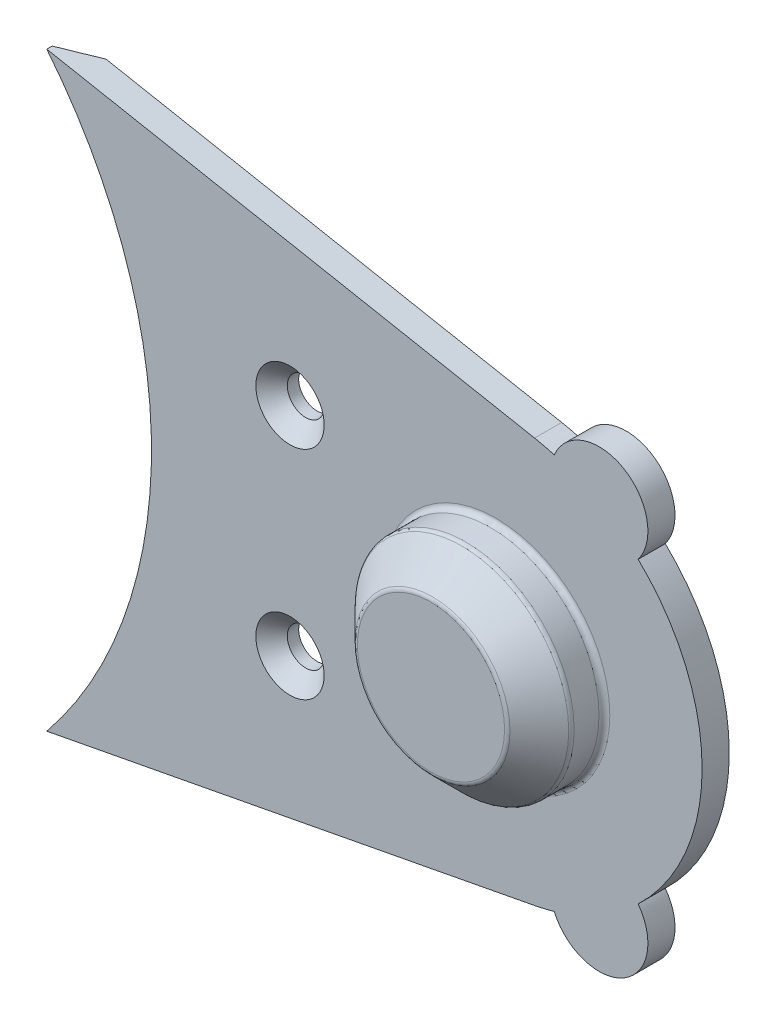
from build123d import *

# Parameters (mm, degrees)
EXTRUSION1_DEPTH                            = 2.5
ESQUISSE25_R                                = 9.991221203
EXTRUSION2_DEPTH                            = 6
CHANFREIN1_SIZE                             = 3
FRAISAGE_POUR_VIS_T_TE_FRAIS_E_M31_AT_COUNT = 2
FRAISAGE_POUR_VIS_T_TE_FRAIS_E_M31_AT_PITCH = 20
ESQUISSE28_R                                = 9
ENL_V_MAT_EXTRU_1_DEPTH                     = 5
CONG_1_R                                    = 0.5
CHANFREIN2_SIZE                             = 2


with BuildPart() as part:
    # Esquisse1 → Extrusion1 (new body)
    with BuildSketch(Plane.XY):
        with BuildLine():
            Line((33.573418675, 27.231644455), (78.554836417, 18.66448869))
            ThreePointArc((78.554836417, 18.66448869), (79.464706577, 18.467982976), (80.363860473, 18.227150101))
            ThreePointArc((80.363860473, 18.227150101), (86.75, 20.351596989), (88.10324479, 13.758814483))
            ThreePointArc((88.10324479, 13.758814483), (94, 0), (88.10324479, -13.758814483))
            ThreePointArc((88.10324479, -13.758814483), (86.75, -20.351596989), (80.363860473, -18.227150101))
            ThreePointArc((80.363860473, -18.227150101), (79.464706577, -18.467982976), (78.554836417, -18.66448869))
            Line((78.554836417, -18.66448869), (33.573418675, -27.231644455))
            ThreePointArc((33.573418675, -27.231644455), (43.22888966, 0), (33.573418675, 27.231644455))
        make_face()
    extrude(amount=EXTRUSION1_DEPTH)

    # Esquisse25 → Extrusion2 (add)
    with BuildSketch(Plane.XY.offset(2.5)):
        with Locations((75, 0)):
            Circle(ESQUISSE25_R)
    extrude(amount=EXTRUSION2_DEPTH)

    # Chanfrein1
    chanfrein1_edges = [part.edges().sort_by_distance(p)[0] for p in [
        (65.008778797, 0, 8.5),
    ]]
    chamfer(chanfrein1_edges, length=CHANFREIN1_SIZE)

    # Esquisse26 → Fraisage pour vis _ t_te frais_e M31 (revolve, cut)
    with BuildSketch(Plane(origin=(56, -10, 2.5), x_dir=(0, -1, 0), z_dir=(1, 0, 0))):
        Polygon((0, 0), (0, 2.5), (1.7, 2.5), (1.7, 1.45), (3.15, 0), align=None)
    fraisage_pour_vis_t_te_frais_e_m31 = revolve(axis=Axis((56, -10, 8.85), (0, 0, -1)), mode=Mode.SUBTRACT)

    # Fraisage pour vis _ t_te frais_e M31 at: Fraisage pour vis _ t_te frais_e M31 ×2
    with Locations(*[(0, i * FRAISAGE_POUR_VIS_T_TE_FRAIS_E_M31_AT_PITCH, 0) for i in range(1, FRAISAGE_POUR_VIS_T_TE_FRAIS_E_M31_AT_COUNT)]):
        add(fraisage_pour_vis_t_te_frais_e_m31, mode=Mode.SUBTRACT)

    # Esquisse28 → Enl_v. mat.-Extru.1 (cut)
    with BuildSketch(Plane(origin=(0, 0, 0), x_dir=(-1, 0, 0), z_dir=(0, 0, -1))):
        with Locations((-75, 0)):
            Circle(ESQUISSE28_R)
    extrude(amount=-ENL_V_MAT_EXTRU_1_DEPTH, mode=Mode.SUBTRACT)

    # Cong_1
    cong_1_edges = [part.edges().sort_by_distance(p)[0] for p in [
        (65.008778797, 0, 2.5),
        (68.008778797, 0, 8.5),
        (65.008778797, 0, 5.5),
        (84, 0, 5),
        (84, 0, 0),
    ]]
    fillet(cong_1_edges, radius=CONG_1_R)

    # Chanfrein2
    chanfrein2_edges = [part.edges().sort_by_distance(p)[0] for p in [
        (43.22888966, 0, 0),
    ]]
    chamfer(chanfrein2_edges, length=CHANFREIN2_SIZE)


solid = part.part
